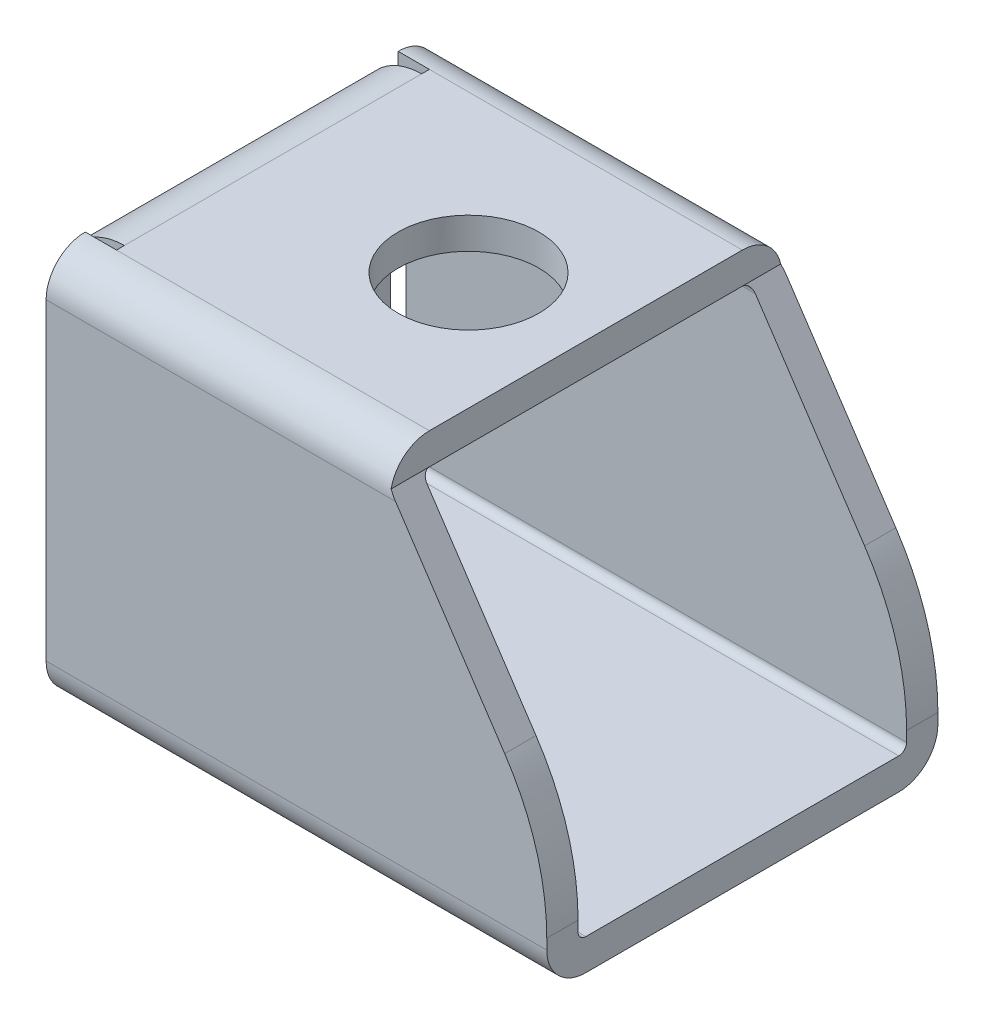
ISO-10303-21;
HEADER;
FILE_DESCRIPTION(('STEP AP214'),'2;1');
FILE_NAME('part.step','',(''),(''),'','','');
FILE_SCHEMA(('AUTOMOTIVE_DESIGN { 1 0 10303 214 1 1 1 1 }'));
ENDSEC;
DATA;
#1=APPLICATION_CONTEXT('core data for automotive mechanical design processes');
#2=APPLICATION_PROTOCOL_DEFINITION('international standard','automotive_design',2000,#1);
#3=PRODUCT_CONTEXT('',#1,'mechanical');
#4=PRODUCT('Part','Part','',(#3));
#5=PRODUCT_RELATED_PRODUCT_CATEGORY('part','',(#4));
#6=PRODUCT_DEFINITION_FORMATION('','',#4);
#7=PRODUCT_DEFINITION_CONTEXT('part definition',#1,'design');
#8=PRODUCT_DEFINITION('design','',#6,#7);
#9=PRODUCT_DEFINITION_SHAPE('','',#8);
#10=(LENGTH_UNIT() NAMED_UNIT(*) SI_UNIT(.MILLI.,.METRE.));
#11=(NAMED_UNIT(*) PLANE_ANGLE_UNIT() SI_UNIT($,.RADIAN.));
#12=(NAMED_UNIT(*) SI_UNIT($,.STERADIAN.) SOLID_ANGLE_UNIT());
#13=UNCERTAINTY_MEASURE_WITH_UNIT(LENGTH_MEASURE(1.E-05),#10,'distance_accuracy_value','');
#14=(GEOMETRIC_REPRESENTATION_CONTEXT(3) GLOBAL_UNCERTAINTY_ASSIGNED_CONTEXT((#13)) GLOBAL_UNIT_ASSIGNED_CONTEXT((#10,
#11,#12)) REPRESENTATION_CONTEXT('',''));
#15=CARTESIAN_POINT('',(0.,0.,0.));
#16=DIRECTION('',(0.,0.,1.));
#17=DIRECTION('',(1.,0.,0.));
#18=AXIS2_PLACEMENT_3D('',#15,#16,#17);
#19=CARTESIAN_POINT('',(2.,0.,0.));
#20=DIRECTION('',(1.,0.,0.));
#21=DIRECTION('',(0.,0.,-1.));
#22=AXIS2_PLACEMENT_3D('',#19,#20,#21);
#23=PLANE('',#22);
#24=DIRECTION('',(0.,1.,0.));
#25=VECTOR('',#24,1.);
#26=CARTESIAN_POINT('',(2.,10.5,9.5));
#27=LINE('',#26,#25);
#28=CARTESIAN_POINT('',(2.,10.5,9.49999999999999));
#29=VERTEX_POINT('',#28);
#30=CARTESIAN_POINT('',(2.,12.5,9.49999999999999));
#31=VERTEX_POINT('',#30);
#32=EDGE_CURVE('E244',#29,#31,#27,.T.);
#33=ORIENTED_EDGE('',*,*,#32,.F.);
#34=DIRECTION('',(0.,0.,1.));
#35=VECTOR('',#34,1.);
#36=CARTESIAN_POINT('',(2.,10.5,-9.99999999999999));
#37=LINE('',#36,#35);
#38=CARTESIAN_POINT('',(2.,10.5,9.99999999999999));
#39=VERTEX_POINT('',#38);
#40=EDGE_CURVE('E233',#29,#39,#37,.T.);
#41=ORIENTED_EDGE('',*,*,#40,.T.);
#42=DIRECTION('',(0.,1.,0.));
#43=VECTOR('',#42,1.);
#44=CARTESIAN_POINT('',(2.,10.5,9.99999999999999));
#45=LINE('',#44,#43);
#46=CARTESIAN_POINT('',(2.,12.5,9.99999999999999));
#47=VERTEX_POINT('',#46);
#48=EDGE_CURVE('E232',#39,#47,#45,.T.);
#49=ORIENTED_EDGE('',*,*,#48,.T.);
#50=DIRECTION('',(0.,0.,-1.));
#51=VECTOR('',#50,1.);
#52=CARTESIAN_POINT('',(2.,12.5,-9.99999999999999));
#53=LINE('',#52,#51);
#54=EDGE_CURVE('E481',#47,#31,#53,.T.);
#55=ORIENTED_EDGE('',*,*,#54,.T.);
#56=EDGE_LOOP('',(#33,#41,#49,#55));
#57=FACE_BOUND('',#56,.T.);
#58=ADVANCED_FACE('F32',(#57),#23,.F.);
#59=DIRECTION('',(0.,-1.,0.));
#60=VECTOR('',#59,1.);
#61=CARTESIAN_POINT('',(2.,12.5,-9.5));
#62=LINE('',#61,#60);
#63=CARTESIAN_POINT('',(2.,12.5,-9.5));
#64=VERTEX_POINT('',#63);
#65=CARTESIAN_POINT('',(2.,10.5,-9.5));
#66=VERTEX_POINT('',#65);
#67=EDGE_CURVE('E49',#64,#66,#62,.T.);
#68=ORIENTED_EDGE('',*,*,#67,.F.);
#69=CARTESIAN_POINT('',(2.,12.5,-9.99999999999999));
#70=VERTEX_POINT('',#69);
#71=EDGE_CURVE('E491',#64,#70,#53,.T.);
#72=ORIENTED_EDGE('',*,*,#71,.T.);
#73=DIRECTION('',(0.,-1.,0.));
#74=VECTOR('',#73,1.);
#75=CARTESIAN_POINT('',(2.,10.5,-9.99999999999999));
#76=LINE('',#75,#74);
#77=CARTESIAN_POINT('',(2.,10.5,-9.99999999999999));
#78=VERTEX_POINT('',#77);
#79=EDGE_CURVE('E228',#70,#78,#76,.T.);
#80=ORIENTED_EDGE('',*,*,#79,.T.);
#81=EDGE_CURVE('E224',#78,#66,#37,.T.);
#82=ORIENTED_EDGE('',*,*,#81,.T.);
#83=EDGE_LOOP('',(#68,#72,#80,#82));
#84=FACE_BOUND('',#83,.T.);
#85=ADVANCED_FACE('F226',(#84),#23,.F.);
#86=CARTESIAN_POINT('',(32.,-10.,9.99999999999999));
#87=DIRECTION('',(1.,0.,0.));
#88=DIRECTION('',(0.,0.,-1.));
#89=AXIS2_PLACEMENT_3D('',#86,#87,#88);
#90=PLANE('',#89);
#91=DIRECTION('',(0.,1.,0.));
#92=VECTOR('',#91,1.);
#93=CARTESIAN_POINT('',(32.,9.99999999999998,-12.5));
#94=LINE('',#93,#92);
#95=CARTESIAN_POINT('',(32.,-9.99999999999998,-12.5));
#96=VERTEX_POINT('',#95);
#97=CARTESIAN_POINT('',(32.,-9.34441020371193,-12.5));
#98=VERTEX_POINT('',#97);
#99=EDGE_CURVE('E389',#96,#98,#94,.T.);
#100=ORIENTED_EDGE('',*,*,#99,.T.);
#101=DIRECTION('',(0.,0.,-1.));
#102=VECTOR('',#101,1.);
#103=CARTESIAN_POINT('',(32.,-9.34441020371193,9.99999999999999));
#104=LINE('',#103,#102);
#105=CARTESIAN_POINT('',(32.,-9.34441020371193,-10.5));
#106=VERTEX_POINT('',#105);
#107=EDGE_CURVE('E333',#98,#106,#104,.F.);
#108=ORIENTED_EDGE('',*,*,#107,.T.);
#109=DIRECTION('',(0.,1.,0.));
#110=VECTOR('',#109,1.);
#111=CARTESIAN_POINT('',(32.,9.99999999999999,-10.5));
#112=LINE('',#111,#110);
#113=CARTESIAN_POINT('',(32.,-9.99999999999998,-10.5));
#114=VERTEX_POINT('',#113);
#115=EDGE_CURVE('E413',#114,#106,#112,.T.);
#116=ORIENTED_EDGE('',*,*,#115,.F.);
#117=CARTESIAN_POINT('',(32.,-10.,-10.));
#118=DIRECTION('',(1.,0.,0.));
#119=DIRECTION('',(0.,0.,-1.));
#120=AXIS2_PLACEMENT_3D('',#117,#118,#119);
#121=CIRCLE('',#120,0.499999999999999);
#122=CARTESIAN_POINT('',(32.,-10.5,-10.));
#123=VERTEX_POINT('',#122);
#124=EDGE_CURVE('E439',#123,#114,#121,.T.);
#125=ORIENTED_EDGE('',*,*,#124,.F.);
#126=DIRECTION('',(0.,0.,-1.));
#127=VECTOR('',#126,1.);
#128=CARTESIAN_POINT('',(32.,-10.5,9.99999999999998));
#129=LINE('',#128,#127);
#130=CARTESIAN_POINT('',(32.,-10.5,9.99999999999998));
#131=VERTEX_POINT('',#130);
#132=EDGE_CURVE('E441',#131,#123,#129,.T.);
#133=ORIENTED_EDGE('',*,*,#132,.F.);
#134=CARTESIAN_POINT('',(32.,-10.,9.99999999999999));
#135=DIRECTION('',(1.,0.,0.));
#136=DIRECTION('',(0.,0.,-1.));
#137=AXIS2_PLACEMENT_3D('',#134,#135,#136);
#138=CIRCLE('',#137,0.5);
#139=CARTESIAN_POINT('',(32.,-10.,10.5));
#140=VERTEX_POINT('',#139);
#141=EDGE_CURVE('E443',#140,#131,#138,.T.);
#142=ORIENTED_EDGE('',*,*,#141,.F.);
#143=DIRECTION('',(0.,-1.,0.));
#144=VECTOR('',#143,1.);
#145=CARTESIAN_POINT('',(32.,9.99999999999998,10.5));
#146=LINE('',#145,#144);
#147=CARTESIAN_POINT('',(32.,-9.34441020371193,10.5));
#148=VERTEX_POINT('',#147);
#149=EDGE_CURVE('E417',#148,#140,#146,.T.);
#150=ORIENTED_EDGE('',*,*,#149,.F.);
#151=DIRECTION('',(0.,0.,-1.));
#152=VECTOR('',#151,1.);
#153=CARTESIAN_POINT('',(32.,-9.34441020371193,9.99999999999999));
#154=LINE('',#153,#152);
#155=CARTESIAN_POINT('',(32.,-9.34441020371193,12.5));
#156=VERTEX_POINT('',#155);
#157=EDGE_CURVE('E335',#148,#156,#154,.F.);
#158=ORIENTED_EDGE('',*,*,#157,.T.);
#159=DIRECTION('',(0.,-1.,0.));
#160=VECTOR('',#159,1.);
#161=CARTESIAN_POINT('',(32.,9.99999999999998,12.5));
#162=LINE('',#161,#160);
#163=CARTESIAN_POINT('',(32.,-9.99999999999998,12.5));
#164=VERTEX_POINT('',#163);
#165=EDGE_CURVE('E367',#156,#164,#162,.T.);
#166=ORIENTED_EDGE('',*,*,#165,.T.);
#167=CARTESIAN_POINT('',(32.,-10.,9.99999999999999));
#168=DIRECTION('',(1.,0.,0.));
#169=DIRECTION('',(0.,0.,-1.));
#170=AXIS2_PLACEMENT_3D('',#167,#168,#169);
#171=CIRCLE('',#170,2.5);
#172=CARTESIAN_POINT('',(32.,-12.5,9.99999999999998));
#173=VERTEX_POINT('',#172);
#174=EDGE_CURVE('E370',#164,#173,#171,.T.);
#175=ORIENTED_EDGE('',*,*,#174,.T.);
#176=DIRECTION('',(0.,0.,-1.));
#177=VECTOR('',#176,1.);
#178=CARTESIAN_POINT('',(32.,-12.5,9.99999999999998));
#179=LINE('',#178,#177);
#180=CARTESIAN_POINT('',(32.,-12.5,-9.99999999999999));
#181=VERTEX_POINT('',#180);
#182=EDGE_CURVE('E394',#173,#181,#179,.T.);
#183=ORIENTED_EDGE('',*,*,#182,.T.);
#184=CARTESIAN_POINT('',(32.,-10.,-10.));
#185=DIRECTION('',(1.,0.,0.));
#186=DIRECTION('',(0.,0.,-1.));
#187=AXIS2_PLACEMENT_3D('',#184,#185,#186);
#188=CIRCLE('',#187,2.5);
#189=EDGE_CURVE('E392',#181,#96,#188,.T.);
#190=ORIENTED_EDGE('',*,*,#189,.T.);
#191=EDGE_LOOP('',(#100,#108,#116,#125,#133,#142,#150,#158,#166,#175,#183,#190));
#192=FACE_BOUND('',#191,.T.);
#193=ADVANCED_FACE('F538',(#192),#90,.T.);
#194=CARTESIAN_POINT('',(32.,9.99999999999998,-12.5));
#195=DIRECTION('',(0.,0.,1.));
#196=DIRECTION('',(0.,-1.,0.));
#197=AXIS2_PLACEMENT_3D('',#194,#195,#196);
#198=PLANE('',#197);
#199=DIRECTION('',(-0.55470019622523,0.832050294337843,0.));
#200=VECTOR('',#199,1.);
#201=CARTESIAN_POINT('',(25.3076923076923,5.53846153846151,-12.5));
#202=LINE('',#201,#200);
#203=CARTESIAN_POINT('',(29.3128047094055,-0.469207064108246,-12.5));
#204=VERTEX_POINT('',#203);
#205=CARTESIAN_POINT('',(22.3333333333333,9.99999999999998,-12.5));
#206=VERTEX_POINT('',#205);
#207=EDGE_CURVE('E449',#204,#206,#202,.T.);
#208=ORIENTED_EDGE('',*,*,#207,.F.);
#209=CARTESIAN_POINT('',(16.,-9.34441020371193,-12.5));
#210=DIRECTION('',(0.,0.,1.));
#211=DIRECTION('',(0.,-1.,0.));
#212=AXIS2_PLACEMENT_3D('',#209,#210,#211);
#213=CIRCLE('',#212,16.);
#214=EDGE_CURVE('E337',#204,#98,#213,.F.);
#215=ORIENTED_EDGE('',*,*,#214,.T.);
#216=ORIENTED_EDGE('',*,*,#99,.F.);
#217=DIRECTION('',(-1.,0.,0.));
#218=VECTOR('',#217,1.);
#219=CARTESIAN_POINT('',(32.,-9.99999999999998,-12.5));
#220=LINE('',#219,#218);
#221=CARTESIAN_POINT('',(0.,-9.99999999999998,-12.5));
#222=VERTEX_POINT('',#221);
#223=EDGE_CURVE('E351',#96,#222,#220,.T.);
#224=ORIENTED_EDGE('',*,*,#223,.T.);
#225=DIRECTION('',(0.,1.,0.));
#226=VECTOR('',#225,1.);
#227=CARTESIAN_POINT('',(0.,9.99999999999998,-12.5));
#228=LINE('',#227,#226);
#229=CARTESIAN_POINT('',(0.,9.99999999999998,-12.5));
#230=VERTEX_POINT('',#229);
#231=EDGE_CURVE('E377',#222,#230,#228,.T.);
#232=ORIENTED_EDGE('',*,*,#231,.T.);
#233=DIRECTION('',(-1.,0.,0.));
#234=VECTOR('',#233,1.);
#235=CARTESIAN_POINT('',(32.,9.99999999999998,-12.5));
#236=LINE('',#235,#234);
#237=EDGE_CURVE('E354',#206,#230,#236,.T.);
#238=ORIENTED_EDGE('',*,*,#237,.F.);
#239=EDGE_LOOP('',(#208,#215,#216,#224,#232,#238));
#240=FACE_BOUND('',#239,.T.);
#241=ADVANCED_FACE('F577',(#240),#198,.F.);
#242=CARTESIAN_POINT('',(32.,10.,-10.));
#243=DIRECTION('',(-1.,0.,0.));
#244=DIRECTION('',(0.,0.,1.));
#245=AXIS2_PLACEMENT_3D('',#242,#243,#244);
#246=CYLINDRICAL_SURFACE('',#245,2.5);
#247=CARTESIAN_POINT('',(22.,10.,-10.));
#248=DIRECTION('',(1.,0.,0.));
#249=DIRECTION('',(0.,0.,-1.));
#250=AXIS2_PLACEMENT_3D('',#247,#248,#249);
#251=CIRCLE('',#250,2.5);
#252=CARTESIAN_POINT('',(22.,10.5,-12.4494897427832));
#253=VERTEX_POINT('',#252);
#254=CARTESIAN_POINT('',(22.,12.5,-9.99999999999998));
#255=VERTEX_POINT('',#254);
#256=EDGE_CURVE('E436',#253,#255,#251,.T.);
#257=ORIENTED_EDGE('',*,*,#256,.F.);
#258=CARTESIAN_POINT('',(22.3333333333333,10.,-10.));
#259=DIRECTION('',(0.832050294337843,0.55470019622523,0.));
#260=DIRECTION('',(-0.55470019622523,0.832050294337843,0.));
#261=AXIS2_PLACEMENT_3D('',#258,#259,#260);
#262=ELLIPSE('',#261,3.00462606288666,2.5);
#263=EDGE_CURVE('E451',#206,#253,#262,.T.);
#264=ORIENTED_EDGE('',*,*,#263,.F.);
#265=ORIENTED_EDGE('',*,*,#237,.T.);
#266=CARTESIAN_POINT('',(0.,10.,-10.));
#267=DIRECTION('',(1.,0.,0.));
#268=DIRECTION('',(0.,0.,1.));
#269=AXIS2_PLACEMENT_3D('',#266,#267,#268);
#270=CIRCLE('',#269,2.5);
#271=CARTESIAN_POINT('',(0.,12.5,-9.99999999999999));
#272=VERTEX_POINT('',#271);
#273=EDGE_CURVE('E374',#230,#272,#270,.T.);
#274=ORIENTED_EDGE('',*,*,#273,.T.);
#275=DIRECTION('',(-1.,0.,0.));
#276=VECTOR('',#275,1.);
#277=CARTESIAN_POINT('',(2.,12.5,-9.99999999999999));
#278=LINE('',#277,#276);
#279=EDGE_CURVE('E476',#70,#272,#278,.T.);
#280=ORIENTED_EDGE('',*,*,#279,.F.);
#281=DIRECTION('',(-1.,0.,0.));
#282=VECTOR('',#281,1.);
#283=CARTESIAN_POINT('',(32.,12.5,-9.99999999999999));
#284=LINE('',#283,#282);
#285=EDGE_CURVE('E356',#255,#70,#284,.T.);
#286=ORIENTED_EDGE('',*,*,#285,.F.);
#287=EDGE_LOOP('',(#257,#264,#265,#274,#280,#286));
#288=FACE_BOUND('',#287,.T.);
#289=ADVANCED_FACE('F571',(#288),#246,.T.);
#290=CARTESIAN_POINT('',(32.,12.5,9.99999999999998));
#291=DIRECTION('',(0.,-1.,0.));
#292=DIRECTION('',(0.,0.,-1.));
#293=AXIS2_PLACEMENT_3D('',#290,#291,#292);
#294=PLANE('',#293);
#295=CARTESIAN_POINT('',(14.5,12.5,0.));
#296=DIRECTION('',(0.,1.,0.));
#297=DIRECTION('',(0.,0.,1.));
#298=AXIS2_PLACEMENT_3D('',#295,#296,#297);
#299=CIRCLE('',#298,4.5);
#300=CARTESIAN_POINT('',(14.5,12.5,4.5));
#301=VERTEX_POINT('',#300);
#302=EDGE_CURVE('E261',#301,#301,#299,.T.);
#303=ORIENTED_EDGE('',*,*,#302,.F.);
#304=EDGE_LOOP('',(#303));
#305=FACE_BOUND('',#304,.T.);
#306=ORIENTED_EDGE('',*,*,#285,.T.);
#307=ORIENTED_EDGE('',*,*,#71,.F.);
#308=DIRECTION('',(0.,0.,-1.));
#309=VECTOR('',#308,1.);
#310=CARTESIAN_POINT('',(2.,12.5,9.5));
#311=LINE('',#310,#309);
#312=EDGE_CURVE('E56',#31,#64,#311,.T.);
#313=ORIENTED_EDGE('',*,*,#312,.F.);
#314=ORIENTED_EDGE('',*,*,#54,.F.);
#315=DIRECTION('',(-1.,0.,0.));
#316=VECTOR('',#315,1.);
#317=CARTESIAN_POINT('',(32.,12.5,9.99999999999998));
#318=LINE('',#317,#316);
#319=CARTESIAN_POINT('',(22.,12.5,10.));
#320=VERTEX_POINT('',#319);
#321=EDGE_CURVE('E359',#320,#47,#318,.T.);
#322=ORIENTED_EDGE('',*,*,#321,.F.);
#323=DIRECTION('',(0.,0.,-1.));
#324=VECTOR('',#323,1.);
#325=CARTESIAN_POINT('',(22.,12.5,75.2330950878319));
#326=LINE('',#325,#324);
#327=EDGE_CURVE('E469',#320,#255,#326,.T.);
#328=ORIENTED_EDGE('',*,*,#327,.T.);
#329=EDGE_LOOP('',(#306,#307,#313,#314,#322,#328));
#330=FACE_BOUND('',#329,.T.);
#331=ADVANCED_FACE('F498',(#305,#330),#294,.F.);
#332=CARTESIAN_POINT('',(32.,10.,10.));
#333=DIRECTION('',(-1.,0.,0.));
#334=DIRECTION('',(0.,0.,1.));
#335=AXIS2_PLACEMENT_3D('',#332,#333,#334);
#336=CYLINDRICAL_SURFACE('',#335,2.5);
#337=CARTESIAN_POINT('',(22.,10.,10.));
#338=DIRECTION('',(1.,0.,0.));
#339=DIRECTION('',(0.,0.,-1.));
#340=AXIS2_PLACEMENT_3D('',#337,#338,#339);
#341=CIRCLE('',#340,2.5);
#342=CARTESIAN_POINT('',(22.,10.5,12.4494897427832));
#343=VERTEX_POINT('',#342);
#344=EDGE_CURVE('E447',#320,#343,#341,.T.);
#345=ORIENTED_EDGE('',*,*,#344,.F.);
#346=ORIENTED_EDGE('',*,*,#321,.T.);
#347=DIRECTION('',(-1.,0.,0.));
#348=VECTOR('',#347,1.);
#349=CARTESIAN_POINT('',(2.,12.5,9.99999999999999));
#350=LINE('',#349,#348);
#351=CARTESIAN_POINT('',(0.,12.5,9.99999999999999));
#352=VERTEX_POINT('',#351);
#353=EDGE_CURVE('E483',#47,#352,#350,.T.);
#354=ORIENTED_EDGE('',*,*,#353,.T.);
#355=CARTESIAN_POINT('',(0.,10.,10.));
#356=DIRECTION('',(1.,0.,0.));
#357=DIRECTION('',(0.,0.,-1.));
#358=AXIS2_PLACEMENT_3D('',#355,#356,#357);
#359=CIRCLE('',#358,2.5);
#360=CARTESIAN_POINT('',(0.,9.99999999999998,12.5));
#361=VERTEX_POINT('',#360);
#362=EDGE_CURVE('E371',#352,#361,#359,.T.);
#363=ORIENTED_EDGE('',*,*,#362,.T.);
#364=DIRECTION('',(-1.,0.,0.));
#365=VECTOR('',#364,1.);
#366=CARTESIAN_POINT('',(32.,9.99999999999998,12.5));
#367=LINE('',#366,#365);
#368=CARTESIAN_POINT('',(22.3333333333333,9.99999999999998,12.5));
#369=VERTEX_POINT('',#368);
#370=EDGE_CURVE('E362',#369,#361,#367,.T.);
#371=ORIENTED_EDGE('',*,*,#370,.F.);
#372=CARTESIAN_POINT('',(22.3333333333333,10.,10.));
#373=DIRECTION('',(0.832050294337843,0.55470019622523,0.));
#374=DIRECTION('',(-0.55470019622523,0.832050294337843,0.));
#375=AXIS2_PLACEMENT_3D('',#372,#373,#374);
#376=ELLIPSE('',#375,3.00462606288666,2.5);
#377=EDGE_CURVE('E453',#343,#369,#376,.T.);
#378=ORIENTED_EDGE('',*,*,#377,.F.);
#379=EDGE_LOOP('',(#345,#346,#354,#363,#371,#378));
#380=FACE_BOUND('',#379,.T.);
#381=ADVANCED_FACE('F501',(#380),#336,.T.);
#382=CARTESIAN_POINT('',(32.,9.99999999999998,12.5));
#383=DIRECTION('',(0.,0.,-1.));
#384=DIRECTION('',(0.,1.,0.));
#385=AXIS2_PLACEMENT_3D('',#382,#383,#384);
#386=PLANE('',#385);
#387=ORIENTED_EDGE('',*,*,#165,.F.);
#388=CARTESIAN_POINT('',(16.,-9.34441020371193,12.5));
#389=DIRECTION('',(0.,0.,-1.));
#390=DIRECTION('',(0.,1.,0.));
#391=AXIS2_PLACEMENT_3D('',#388,#389,#390);
#392=CIRCLE('',#391,16.);
#393=CARTESIAN_POINT('',(29.3128047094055,-0.469207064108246,12.5));
#394=VERTEX_POINT('',#393);
#395=EDGE_CURVE('E11',#156,#394,#392,.F.);
#396=ORIENTED_EDGE('',*,*,#395,.T.);
#397=DIRECTION('',(0.55470019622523,-0.832050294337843,0.));
#398=VECTOR('',#397,1.);
#399=CARTESIAN_POINT('',(25.3076923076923,5.53846153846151,12.5));
#400=LINE('',#399,#398);
#401=EDGE_CURVE('E455',#369,#394,#400,.T.);
#402=ORIENTED_EDGE('',*,*,#401,.F.);
#403=ORIENTED_EDGE('',*,*,#370,.T.);
#404=DIRECTION('',(0.,-1.,0.));
#405=VECTOR('',#404,1.);
#406=CARTESIAN_POINT('',(0.,9.99999999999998,12.5));
#407=LINE('',#406,#405);
#408=CARTESIAN_POINT('',(0.,-9.99999999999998,12.5));
#409=VERTEX_POINT('',#408);
#410=EDGE_CURVE('E368',#361,#409,#407,.T.);
#411=ORIENTED_EDGE('',*,*,#410,.T.);
#412=DIRECTION('',(-1.,0.,0.));
#413=VECTOR('',#412,1.);
#414=CARTESIAN_POINT('',(32.,-9.99999999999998,12.5));
#415=LINE('',#414,#413);
#416=EDGE_CURVE('E364',#164,#409,#415,.T.);
#417=ORIENTED_EDGE('',*,*,#416,.F.);
#418=EDGE_LOOP('',(#387,#396,#402,#403,#411,#417));
#419=FACE_BOUND('',#418,.T.);
#420=ADVANCED_FACE('F526',(#419),#386,.F.);
#421=CARTESIAN_POINT('',(32.,10.,10.));
#422=DIRECTION('',(-1.,0.,0.));
#423=DIRECTION('',(0.,0.,1.));
#424=AXIS2_PLACEMENT_3D('',#421,#422,#423);
#425=CYLINDRICAL_SURFACE('',#424,0.5);
#426=DIRECTION('',(-1.,0.,0.));
#427=VECTOR('',#426,1.);
#428=CARTESIAN_POINT('',(32.,10.5,9.99999999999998));
#429=LINE('',#428,#427);
#430=CARTESIAN_POINT('',(22.,10.5,9.99999999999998));
#431=VERTEX_POINT('',#430);
#432=EDGE_CURVE('E411',#431,#39,#429,.T.);
#433=ORIENTED_EDGE('',*,*,#432,.F.);
#434=CARTESIAN_POINT('',(22.3333333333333,10.,10.));
#435=DIRECTION('',(0.832050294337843,0.55470019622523,0.));
#436=DIRECTION('',(-0.55470019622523,0.832050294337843,0.));
#437=AXIS2_PLACEMENT_3D('',#434,#435,#436);
#438=ELLIPSE('',#437,0.600925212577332,0.5);
#439=CARTESIAN_POINT('',(22.3333333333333,9.99999999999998,10.5));
#440=VERTEX_POINT('',#439);
#441=EDGE_CURVE('E458',#431,#440,#438,.T.);
#442=ORIENTED_EDGE('',*,*,#441,.T.);
#443=DIRECTION('',(-1.,0.,0.));
#444=VECTOR('',#443,1.);
#445=CARTESIAN_POINT('',(32.,9.99999999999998,10.5));
#446=LINE('',#445,#444);
#447=CARTESIAN_POINT('',(0.,9.99999999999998,10.5));
#448=VERTEX_POINT('',#447);
#449=EDGE_CURVE('E387',#440,#448,#446,.T.);
#450=ORIENTED_EDGE('',*,*,#449,.T.);
#451=CARTESIAN_POINT('',(0.,10.,10.));
#452=DIRECTION('',(1.,0.,0.));
#453=DIRECTION('',(0.,0.,-1.));
#454=AXIS2_PLACEMENT_3D('',#451,#452,#453);
#455=CIRCLE('',#454,0.5);
#456=CARTESIAN_POINT('',(0.,10.5,9.99999999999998));
#457=VERTEX_POINT('',#456);
#458=EDGE_CURVE('E433',#457,#448,#455,.T.);
#459=ORIENTED_EDGE('',*,*,#458,.F.);
#460=DIRECTION('',(-1.,0.,0.));
#461=VECTOR('',#460,1.);
#462=CARTESIAN_POINT('',(2.,10.5,9.99999999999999));
#463=LINE('',#462,#461);
#464=EDGE_CURVE('E480',#39,#457,#463,.T.);
#465=ORIENTED_EDGE('',*,*,#464,.F.);
#466=EDGE_LOOP('',(#433,#442,#450,#459,#465));
#467=FACE_BOUND('',#466,.T.);
#468=ADVANCED_FACE('F516',(#467),#425,.F.);
#469=CARTESIAN_POINT('',(32.,9.99999999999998,10.5));
#470=DIRECTION('',(0.,0.,-1.));
#471=DIRECTION('',(0.,1.,0.));
#472=AXIS2_PLACEMENT_3D('',#469,#470,#471);
#473=PLANE('',#472);
#474=DIRECTION('',(0.55470019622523,-0.832050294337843,0.));
#475=VECTOR('',#474,1.);
#476=CARTESIAN_POINT('',(25.3076923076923,5.53846153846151,10.5));
#477=LINE('',#476,#475);
#478=CARTESIAN_POINT('',(29.3128047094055,-0.469207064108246,10.5));
#479=VERTEX_POINT('',#478);
#480=EDGE_CURVE('E461',#440,#479,#477,.T.);
#481=ORIENTED_EDGE('',*,*,#480,.T.);
#482=CARTESIAN_POINT('',(16.,-9.34441020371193,10.5));
#483=DIRECTION('',(0.,0.,-1.));
#484=DIRECTION('',(0.,1.,0.));
#485=AXIS2_PLACEMENT_3D('',#482,#483,#484);
#486=CIRCLE('',#485,16.);
#487=EDGE_CURVE('E41',#479,#148,#486,.T.);
#488=ORIENTED_EDGE('',*,*,#487,.T.);
#489=ORIENTED_EDGE('',*,*,#149,.T.);
#490=DIRECTION('',(-1.,0.,0.));
#491=VECTOR('',#490,1.);
#492=CARTESIAN_POINT('',(32.,-10.,10.5));
#493=LINE('',#492,#491);
#494=CARTESIAN_POINT('',(0.,-10.,10.5));
#495=VERTEX_POINT('',#494);
#496=EDGE_CURVE('E399',#140,#495,#493,.T.);
#497=ORIENTED_EDGE('',*,*,#496,.T.);
#498=DIRECTION('',(0.,-1.,0.));
#499=VECTOR('',#498,1.);
#500=CARTESIAN_POINT('',(0.,9.99999999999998,10.5));
#501=LINE('',#500,#499);
#502=EDGE_CURVE('E430',#448,#495,#501,.T.);
#503=ORIENTED_EDGE('',*,*,#502,.F.);
#504=ORIENTED_EDGE('',*,*,#449,.F.);
#505=EDGE_LOOP('',(#481,#488,#489,#497,#503,#504));
#506=FACE_BOUND('',#505,.T.);
#507=ADVANCED_FACE('F534',(#506),#473,.T.);
#508=CARTESIAN_POINT('',(32.,9.99999999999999,-10.5));
#509=DIRECTION('',(0.,0.,1.));
#510=DIRECTION('',(0.,-1.,0.));
#511=AXIS2_PLACEMENT_3D('',#508,#509,#510);
#512=PLANE('',#511);
#513=ORIENTED_EDGE('',*,*,#115,.T.);
#514=CARTESIAN_POINT('',(16.,-9.34441020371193,-10.5));
#515=DIRECTION('',(0.,0.,1.));
#516=DIRECTION('',(0.,-1.,0.));
#517=AXIS2_PLACEMENT_3D('',#514,#515,#516);
#518=CIRCLE('',#517,16.);
#519=CARTESIAN_POINT('',(29.3128047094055,-0.469207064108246,-10.5));
#520=VERTEX_POINT('',#519);
#521=EDGE_CURVE('E331',#106,#520,#518,.T.);
#522=ORIENTED_EDGE('',*,*,#521,.T.);
#523=DIRECTION('',(-0.55470019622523,0.832050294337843,0.));
#524=VECTOR('',#523,1.);
#525=CARTESIAN_POINT('',(25.3076923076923,5.53846153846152,-10.5));
#526=LINE('',#525,#524);
#527=CARTESIAN_POINT('',(22.3333333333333,9.99999999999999,-10.5));
#528=VERTEX_POINT('',#527);
#529=EDGE_CURVE('E464',#520,#528,#526,.T.);
#530=ORIENTED_EDGE('',*,*,#529,.T.);
#531=DIRECTION('',(-1.,0.,0.));
#532=VECTOR('',#531,1.);
#533=CARTESIAN_POINT('',(32.,9.99999999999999,-10.5));
#534=LINE('',#533,#532);
#535=CARTESIAN_POINT('',(0.,9.99999999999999,-10.5));
#536=VERTEX_POINT('',#535);
#537=EDGE_CURVE('E407',#528,#536,#534,.T.);
#538=ORIENTED_EDGE('',*,*,#537,.T.);
#539=DIRECTION('',(0.,1.,0.));
#540=VECTOR('',#539,1.);
#541=CARTESIAN_POINT('',(0.,9.99999999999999,-10.5));
#542=LINE('',#541,#540);
#543=CARTESIAN_POINT('',(0.,-9.99999999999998,-10.5));
#544=VERTEX_POINT('',#543);
#545=EDGE_CURVE('E418',#544,#536,#542,.T.);
#546=ORIENTED_EDGE('',*,*,#545,.F.);
#547=DIRECTION('',(-1.,0.,0.));
#548=VECTOR('',#547,1.);
#549=CARTESIAN_POINT('',(32.,-9.99999999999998,-10.5));
#550=LINE('',#549,#548);
#551=EDGE_CURVE('E405',#114,#544,#550,.T.);
#552=ORIENTED_EDGE('',*,*,#551,.F.);
#553=EDGE_LOOP('',(#513,#522,#530,#538,#546,#552));
#554=FACE_BOUND('',#553,.T.);
#555=ADVANCED_FACE('F557',(#554),#512,.T.);
#556=CARTESIAN_POINT('',(32.,10.,-10.));
#557=DIRECTION('',(-1.,0.,0.));
#558=DIRECTION('',(0.,0.,1.));
#559=AXIS2_PLACEMENT_3D('',#556,#557,#558);
#560=CYLINDRICAL_SURFACE('',#559,0.5);
#561=ORIENTED_EDGE('',*,*,#537,.F.);
#562=CARTESIAN_POINT('',(22.3333333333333,10.,-10.));
#563=DIRECTION('',(0.832050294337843,0.55470019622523,0.));
#564=DIRECTION('',(-0.55470019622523,0.832050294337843,0.));
#565=AXIS2_PLACEMENT_3D('',#562,#563,#564);
#566=ELLIPSE('',#565,0.600925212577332,0.5);
#567=CARTESIAN_POINT('',(22.,10.5,-9.99999999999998));
#568=VERTEX_POINT('',#567);
#569=EDGE_CURVE('E466',#528,#568,#566,.T.);
#570=ORIENTED_EDGE('',*,*,#569,.T.);
#571=DIRECTION('',(-1.,0.,0.));
#572=VECTOR('',#571,1.);
#573=CARTESIAN_POINT('',(32.,10.5,-9.99999999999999));
#574=LINE('',#573,#572);
#575=EDGE_CURVE('E409',#568,#78,#574,.T.);
#576=ORIENTED_EDGE('',*,*,#575,.T.);
#577=DIRECTION('',(-1.,0.,0.));
#578=VECTOR('',#577,1.);
#579=CARTESIAN_POINT('',(2.,10.5,-9.99999999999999));
#580=LINE('',#579,#578);
#581=CARTESIAN_POINT('',(0.,10.5,-9.99999999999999));
#582=VERTEX_POINT('',#581);
#583=EDGE_CURVE('E477',#78,#582,#580,.T.);
#584=ORIENTED_EDGE('',*,*,#583,.T.);
#585=CARTESIAN_POINT('',(0.,10.,-10.));
#586=DIRECTION('',(1.,0.,0.));
#587=DIRECTION('',(0.,0.,1.));
#588=AXIS2_PLACEMENT_3D('',#585,#586,#587);
#589=CIRCLE('',#588,0.5);
#590=EDGE_CURVE('E414',#536,#582,#589,.T.);
#591=ORIENTED_EDGE('',*,*,#590,.F.);
#592=EDGE_LOOP('',(#561,#570,#576,#584,#591));
#593=FACE_BOUND('',#592,.T.);
#594=ADVANCED_FACE('F563',(#593),#560,.F.);
#595=CARTESIAN_POINT('',(32.,10.5,9.99999999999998));
#596=DIRECTION('',(0.,-1.,0.));
#597=DIRECTION('',(0.,0.,-1.));
#598=AXIS2_PLACEMENT_3D('',#595,#596,#597);
#599=PLANE('',#598);
#600=CARTESIAN_POINT('',(14.5,10.5,0.));
#601=DIRECTION('',(0.,-1.,0.));
#602=DIRECTION('',(0.,0.,-1.));
#603=AXIS2_PLACEMENT_3D('',#600,#601,#602);
#604=CIRCLE('',#603,4.5);
#605=CARTESIAN_POINT('',(14.5,10.5,-4.5));
#606=VERTEX_POINT('',#605);
#607=EDGE_CURVE('E668',#606,#606,#604,.F.);
#608=ORIENTED_EDGE('',*,*,#607,.T.);
#609=EDGE_LOOP('',(#608));
#610=FACE_BOUND('',#609,.T.);
#611=ORIENTED_EDGE('',*,*,#81,.F.);
#612=ORIENTED_EDGE('',*,*,#575,.F.);
#613=DIRECTION('',(0.,0.,1.));
#614=VECTOR('',#613,1.);
#615=CARTESIAN_POINT('',(22.,10.5,9.99999999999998));
#616=LINE('',#615,#614);
#617=EDGE_CURVE('E342',#568,#431,#616,.T.);
#618=ORIENTED_EDGE('',*,*,#617,.T.);
#619=ORIENTED_EDGE('',*,*,#432,.T.);
#620=ORIENTED_EDGE('',*,*,#40,.F.);
#621=DIRECTION('',(0.,0.,1.));
#622=VECTOR('',#621,1.);
#623=CARTESIAN_POINT('',(2.,10.5,-9.5));
#624=LINE('',#623,#622);
#625=EDGE_CURVE('E237',#66,#29,#624,.T.);
#626=ORIENTED_EDGE('',*,*,#625,.F.);
#627=EDGE_LOOP('',(#611,#612,#618,#619,#620,#626));
#628=FACE_BOUND('',#627,.T.);
#629=ADVANCED_FACE('F239',(#610,#628),#599,.T.);
#630=CARTESIAN_POINT('',(0.,-10.,9.99999999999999));
#631=DIRECTION('',(1.,0.,0.));
#632=DIRECTION('',(0.,0.,-1.));
#633=AXIS2_PLACEMENT_3D('',#630,#631,#632);
#634=PLANE('',#633);
#635=ORIENTED_EDGE('',*,*,#590,.T.);
#636=DIRECTION('',(0.,-1.,0.));
#637=VECTOR('',#636,1.);
#638=CARTESIAN_POINT('',(0.,10.5,-9.99999999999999));
#639=LINE('',#638,#637);
#640=EDGE_CURVE('E317',#272,#582,#639,.T.);
#641=ORIENTED_EDGE('',*,*,#640,.F.);
#642=ORIENTED_EDGE('',*,*,#273,.F.);
#643=ORIENTED_EDGE('',*,*,#231,.F.);
#644=CARTESIAN_POINT('',(0.,-10.,-10.));
#645=DIRECTION('',(1.,0.,0.));
#646=DIRECTION('',(0.,0.,-1.));
#647=AXIS2_PLACEMENT_3D('',#644,#645,#646);
#648=CIRCLE('',#647,2.5);
#649=CARTESIAN_POINT('',(0.,-12.5,-9.99999999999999));
#650=VERTEX_POINT('',#649);
#651=EDGE_CURVE('E380',#650,#222,#648,.T.);
#652=ORIENTED_EDGE('',*,*,#651,.F.);
#653=DIRECTION('',(0.,0.,-1.));
#654=VECTOR('',#653,1.);
#655=CARTESIAN_POINT('',(0.,-12.5,9.99999999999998));
#656=LINE('',#655,#654);
#657=CARTESIAN_POINT('',(0.,-12.5,9.99999999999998));
#658=VERTEX_POINT('',#657);
#659=EDGE_CURVE('E382',#658,#650,#656,.T.);
#660=ORIENTED_EDGE('',*,*,#659,.F.);
#661=CARTESIAN_POINT('',(0.,-10.,9.99999999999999));
#662=DIRECTION('',(1.,0.,0.));
#663=DIRECTION('',(0.,0.,-1.));
#664=AXIS2_PLACEMENT_3D('',#661,#662,#663);
#665=CIRCLE('',#664,2.5);
#666=EDGE_CURVE('E384',#409,#658,#665,.T.);
#667=ORIENTED_EDGE('',*,*,#666,.F.);
#668=ORIENTED_EDGE('',*,*,#410,.F.);
#669=ORIENTED_EDGE('',*,*,#362,.F.);
#670=DIRECTION('',(0.,1.,0.));
#671=VECTOR('',#670,1.);
#672=CARTESIAN_POINT('',(0.,10.5,9.99999999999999));
#673=LINE('',#672,#671);
#674=EDGE_CURVE('E319',#457,#352,#673,.T.);
#675=ORIENTED_EDGE('',*,*,#674,.F.);
#676=ORIENTED_EDGE('',*,*,#458,.T.);
#677=ORIENTED_EDGE('',*,*,#502,.T.);
#678=CARTESIAN_POINT('',(0.,-10.,9.99999999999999));
#679=DIRECTION('',(1.,0.,0.));
#680=DIRECTION('',(0.,0.,-1.));
#681=AXIS2_PLACEMENT_3D('',#678,#679,#680);
#682=CIRCLE('',#681,0.5);
#683=CARTESIAN_POINT('',(0.,-10.5,9.99999999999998));
#684=VERTEX_POINT('',#683);
#685=EDGE_CURVE('E427',#495,#684,#682,.T.);
#686=ORIENTED_EDGE('',*,*,#685,.T.);
#687=DIRECTION('',(0.,0.,-1.));
#688=VECTOR('',#687,1.);
#689=CARTESIAN_POINT('',(0.,-10.5,9.99999999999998));
#690=LINE('',#689,#688);
#691=CARTESIAN_POINT('',(0.,-10.5,-10.));
#692=VERTEX_POINT('',#691);
#693=EDGE_CURVE('E424',#684,#692,#690,.T.);
#694=ORIENTED_EDGE('',*,*,#693,.T.);
#695=CARTESIAN_POINT('',(0.,-10.,-10.));
#696=DIRECTION('',(1.,0.,0.));
#697=DIRECTION('',(0.,0.,-1.));
#698=AXIS2_PLACEMENT_3D('',#695,#696,#697);
#699=CIRCLE('',#698,0.499999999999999);
#700=EDGE_CURVE('E421',#692,#544,#699,.T.);
#701=ORIENTED_EDGE('',*,*,#700,.T.);
#702=ORIENTED_EDGE('',*,*,#545,.T.);
#703=EDGE_LOOP('',(#635,#641,#642,#643,#652,#660,#667,#668,#669,#675,#676,#677,#686,#694,#701,#702));
#704=FACE_BOUND('',#703,.T.);
#705=ADVANCED_FACE('F521',(#704),#634,.F.);
#706=CARTESIAN_POINT('',(32.,-10.,9.99999999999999));
#707=DIRECTION('',(-1.,0.,0.));
#708=DIRECTION('',(0.,0.,1.));
#709=AXIS2_PLACEMENT_3D('',#706,#707,#708);
#710=CYLINDRICAL_SURFACE('',#709,2.5);
#711=ORIENTED_EDGE('',*,*,#666,.T.);
#712=DIRECTION('',(-1.,0.,0.));
#713=VECTOR('',#712,1.);
#714=CARTESIAN_POINT('',(32.,-12.5,9.99999999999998));
#715=LINE('',#714,#713);
#716=EDGE_CURVE('E345',#173,#658,#715,.T.);
#717=ORIENTED_EDGE('',*,*,#716,.F.);
#718=ORIENTED_EDGE('',*,*,#174,.F.);
#719=ORIENTED_EDGE('',*,*,#416,.T.);
#720=EDGE_LOOP('',(#711,#717,#718,#719));
#721=FACE_BOUND('',#720,.T.);
#722=ADVANCED_FACE('F590',(#721),#710,.T.);
#723=CARTESIAN_POINT('',(32.,-12.5,9.99999999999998));
#724=DIRECTION('',(0.,1.,0.));
#725=DIRECTION('',(0.,0.,1.));
#726=AXIS2_PLACEMENT_3D('',#723,#724,#725);
#727=PLANE('',#726);
#728=ORIENTED_EDGE('',*,*,#659,.T.);
#729=DIRECTION('',(-1.,0.,0.));
#730=VECTOR('',#729,1.);
#731=CARTESIAN_POINT('',(32.,-12.5,-9.99999999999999));
#732=LINE('',#731,#730);
#733=EDGE_CURVE('E348',#181,#650,#732,.T.);
#734=ORIENTED_EDGE('',*,*,#733,.F.);
#735=ORIENTED_EDGE('',*,*,#182,.F.);
#736=ORIENTED_EDGE('',*,*,#716,.T.);
#737=EDGE_LOOP('',(#728,#734,#735,#736));
#738=FACE_BOUND('',#737,.T.);
#739=ADVANCED_FACE('F586',(#738),#727,.F.);
#740=CARTESIAN_POINT('',(32.,-10.,-10.));
#741=DIRECTION('',(-1.,0.,0.));
#742=DIRECTION('',(0.,0.,1.));
#743=AXIS2_PLACEMENT_3D('',#740,#741,#742);
#744=CYLINDRICAL_SURFACE('',#743,2.5);
#745=ORIENTED_EDGE('',*,*,#651,.T.);
#746=ORIENTED_EDGE('',*,*,#223,.F.);
#747=ORIENTED_EDGE('',*,*,#189,.F.);
#748=ORIENTED_EDGE('',*,*,#733,.T.);
#749=EDGE_LOOP('',(#745,#746,#747,#748));
#750=FACE_BOUND('',#749,.T.);
#751=ADVANCED_FACE('F582',(#750),#744,.T.);
#752=CARTESIAN_POINT('',(32.,-10.,9.99999999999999));
#753=DIRECTION('',(-1.,0.,0.));
#754=DIRECTION('',(0.,0.,1.));
#755=AXIS2_PLACEMENT_3D('',#752,#753,#754);
#756=CYLINDRICAL_SURFACE('',#755,0.5);
#757=ORIENTED_EDGE('',*,*,#685,.F.);
#758=ORIENTED_EDGE('',*,*,#496,.F.);
#759=ORIENTED_EDGE('',*,*,#141,.T.);
#760=DIRECTION('',(-1.,0.,0.));
#761=VECTOR('',#760,1.);
#762=CARTESIAN_POINT('',(32.,-10.5,9.99999999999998));
#763=LINE('',#762,#761);
#764=EDGE_CURVE('E401',#131,#684,#763,.T.);
#765=ORIENTED_EDGE('',*,*,#764,.T.);
#766=EDGE_LOOP('',(#757,#758,#759,#765));
#767=FACE_BOUND('',#766,.T.);
#768=ADVANCED_FACE('F544',(#767),#756,.F.);
#769=CARTESIAN_POINT('',(32.,-10.5,9.99999999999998));
#770=DIRECTION('',(0.,1.,0.));
#771=DIRECTION('',(0.,0.,1.));
#772=AXIS2_PLACEMENT_3D('',#769,#770,#771);
#773=PLANE('',#772);
#774=ORIENTED_EDGE('',*,*,#693,.F.);
#775=ORIENTED_EDGE('',*,*,#764,.F.);
#776=ORIENTED_EDGE('',*,*,#132,.T.);
#777=DIRECTION('',(-1.,0.,0.));
#778=VECTOR('',#777,1.);
#779=CARTESIAN_POINT('',(32.,-10.5,-10.));
#780=LINE('',#779,#778);
#781=EDGE_CURVE('E403',#123,#692,#780,.T.);
#782=ORIENTED_EDGE('',*,*,#781,.T.);
#783=EDGE_LOOP('',(#774,#775,#776,#782));
#784=FACE_BOUND('',#783,.T.);
#785=ADVANCED_FACE('F547',(#784),#773,.T.);
#786=CARTESIAN_POINT('',(32.,-10.,-10.));
#787=DIRECTION('',(-1.,0.,0.));
#788=DIRECTION('',(0.,0.,1.));
#789=AXIS2_PLACEMENT_3D('',#786,#787,#788);
#790=CYLINDRICAL_SURFACE('',#789,0.499999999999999);
#791=ORIENTED_EDGE('',*,*,#700,.F.);
#792=ORIENTED_EDGE('',*,*,#781,.F.);
#793=ORIENTED_EDGE('',*,*,#124,.T.);
#794=ORIENTED_EDGE('',*,*,#551,.T.);
#795=EDGE_LOOP('',(#791,#792,#793,#794));
#796=FACE_BOUND('',#795,.T.);
#797=ADVANCED_FACE('F553',(#796),#790,.F.);
#798=CARTESIAN_POINT('',(22.,12.5,75.2330950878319));
#799=DIRECTION('',(1.,0.,0.));
#800=DIRECTION('',(0.,0.,-1.));
#801=AXIS2_PLACEMENT_3D('',#798,#799,#800);
#802=PLANE('',#801);
#803=DIRECTION('',(0.,0.,-1.));
#804=VECTOR('',#803,1.);
#805=CARTESIAN_POINT('',(22.,10.5,75.2330950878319));
#806=LINE('',#805,#804);
#807=EDGE_CURVE('E473',#568,#253,#806,.T.);
#808=ORIENTED_EDGE('',*,*,#807,.T.);
#809=ORIENTED_EDGE('',*,*,#256,.T.);
#810=ORIENTED_EDGE('',*,*,#327,.F.);
#811=ORIENTED_EDGE('',*,*,#344,.T.);
#812=EDGE_CURVE('E472',#343,#431,#806,.T.);
#813=ORIENTED_EDGE('',*,*,#812,.T.);
#814=ORIENTED_EDGE('',*,*,#617,.F.);
#815=EDGE_LOOP('',(#808,#809,#810,#811,#813,#814));
#816=FACE_BOUND('',#815,.T.);
#817=ADVANCED_FACE('F507',(#816),#802,.T.);
#818=CARTESIAN_POINT('',(22.,10.5,75.2330950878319));
#819=DIRECTION('',(0.832050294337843,0.55470019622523,0.));
#820=DIRECTION('',(-0.55470019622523,0.832050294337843,0.));
#821=AXIS2_PLACEMENT_3D('',#818,#819,#820);
#822=PLANE('',#821);
#823=ORIENTED_EDGE('',*,*,#529,.F.);
#824=DIRECTION('',(0.,0.,-1.));
#825=VECTOR('',#824,1.);
#826=CARTESIAN_POINT('',(29.3128047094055,-0.469207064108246,75.2330950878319));
#827=LINE('',#826,#825);
#828=EDGE_CURVE('E339',#520,#204,#827,.T.);
#829=ORIENTED_EDGE('',*,*,#828,.T.);
#830=ORIENTED_EDGE('',*,*,#207,.T.);
#831=ORIENTED_EDGE('',*,*,#263,.T.);
#832=ORIENTED_EDGE('',*,*,#807,.F.);
#833=ORIENTED_EDGE('',*,*,#569,.F.);
#834=EDGE_LOOP('',(#823,#829,#830,#831,#832,#833));
#835=FACE_BOUND('',#834,.T.);
#836=ADVANCED_FACE('F597',(#835),#822,.T.);
#837=ORIENTED_EDGE('',*,*,#401,.T.);
#838=DIRECTION('',(0.,0.,-1.));
#839=VECTOR('',#838,1.);
#840=CARTESIAN_POINT('',(29.3128047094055,-0.469207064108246,75.2330950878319));
#841=LINE('',#840,#839);
#842=EDGE_CURVE('E328',#394,#479,#841,.T.);
#843=ORIENTED_EDGE('',*,*,#842,.T.);
#844=ORIENTED_EDGE('',*,*,#480,.F.);
#845=ORIENTED_EDGE('',*,*,#441,.F.);
#846=ORIENTED_EDGE('',*,*,#812,.F.);
#847=ORIENTED_EDGE('',*,*,#377,.T.);
#848=EDGE_LOOP('',(#837,#843,#844,#845,#846,#847));
#849=FACE_BOUND('',#848,.T.);
#850=ADVANCED_FACE('F511',(#849),#822,.T.);
#851=CARTESIAN_POINT('',(16.,-9.34441020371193,75.2330950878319));
#852=DIRECTION('',(0.,0.,-1.));
#853=DIRECTION('',(-1.,0.,0.));
#854=AXIS2_PLACEMENT_3D('',#851,#852,#853);
#855=CYLINDRICAL_SURFACE('',#854,16.);
#856=ORIENTED_EDGE('',*,*,#521,.F.);
#857=ORIENTED_EDGE('',*,*,#107,.F.);
#858=ORIENTED_EDGE('',*,*,#214,.F.);
#859=ORIENTED_EDGE('',*,*,#828,.F.);
#860=EDGE_LOOP('',(#856,#857,#858,#859));
#861=FACE_BOUND('',#860,.T.);
#862=ADVANCED_FACE('F594',(#861),#855,.T.);
#863=CARTESIAN_POINT('',(16.,-9.34441020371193,75.2330950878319));
#864=DIRECTION('',(0.,0.,-1.));
#865=DIRECTION('',(-1.,0.,0.));
#866=AXIS2_PLACEMENT_3D('',#863,#864,#865);
#867=CYLINDRICAL_SURFACE('',#866,16.);
#868=ORIENTED_EDGE('',*,*,#395,.F.);
#869=ORIENTED_EDGE('',*,*,#157,.F.);
#870=ORIENTED_EDGE('',*,*,#487,.F.);
#871=ORIENTED_EDGE('',*,*,#842,.F.);
#872=EDGE_LOOP('',(#868,#869,#870,#871));
#873=FACE_BOUND('',#872,.T.);
#874=ADVANCED_FACE('F34',(#873),#867,.T.);
#875=CARTESIAN_POINT('',(2.,10.5,-9.99999999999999));
#876=DIRECTION('',(0.,0.,-1.));
#877=DIRECTION('',(-1.,0.,0.));
#878=AXIS2_PLACEMENT_3D('',#875,#876,#877);
#879=PLANE('',#878);
#880=ORIENTED_EDGE('',*,*,#640,.T.);
#881=ORIENTED_EDGE('',*,*,#583,.F.);
#882=ORIENTED_EDGE('',*,*,#79,.F.);
#883=ORIENTED_EDGE('',*,*,#279,.T.);
#884=EDGE_LOOP('',(#880,#881,#882,#883));
#885=FACE_BOUND('',#884,.T.);
#886=ADVANCED_FACE('F616',(#885),#879,.F.);
#887=CARTESIAN_POINT('',(2.,10.5,9.99999999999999));
#888=DIRECTION('',(0.,0.,1.));
#889=DIRECTION('',(1.,0.,0.));
#890=AXIS2_PLACEMENT_3D('',#887,#888,#889);
#891=PLANE('',#890);
#892=ORIENTED_EDGE('',*,*,#674,.T.);
#893=ORIENTED_EDGE('',*,*,#353,.F.);
#894=ORIENTED_EDGE('',*,*,#48,.F.);
#895=ORIENTED_EDGE('',*,*,#464,.T.);
#896=EDGE_LOOP('',(#892,#893,#894,#895));
#897=FACE_BOUND('',#896,.T.);
#898=ADVANCED_FACE('F519',(#897),#891,.F.);
#899=CARTESIAN_POINT('',(0.,8.5,-9.5));
#900=DIRECTION('',(1.,0.,0.));
#901=DIRECTION('',(0.,0.,-1.));
#902=AXIS2_PLACEMENT_3D('',#899,#900,#901);
#903=PLANE('',#902);
#904=DIRECTION('',(0.,0.,1.));
#905=VECTOR('',#904,1.);
#906=CARTESIAN_POINT('',(0.,8.5,-9.5));
#907=LINE('',#906,#905);
#908=CARTESIAN_POINT('',(0.,8.5,-9.5));
#909=VERTEX_POINT('',#908);
#910=CARTESIAN_POINT('',(0.,8.5,9.5));
#911=VERTEX_POINT('',#910);
#912=EDGE_CURVE('E251',#909,#911,#907,.T.);
#913=ORIENTED_EDGE('',*,*,#912,.T.);
#914=DIRECTION('',(0.,-1.,0.));
#915=VECTOR('',#914,1.);
#916=CARTESIAN_POINT('',(0.,8.5,9.5));
#917=LINE('',#916,#915);
#918=CARTESIAN_POINT('',(0.,-9.00000000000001,9.5));
#919=VERTEX_POINT('',#918);
#920=EDGE_CURVE('E310',#911,#919,#917,.T.);
#921=ORIENTED_EDGE('',*,*,#920,.T.);
#922=DIRECTION('',(0.,0.,1.));
#923=VECTOR('',#922,1.);
#924=CARTESIAN_POINT('',(0.,-9.00000000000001,-9.5));
#925=LINE('',#924,#923);
#926=CARTESIAN_POINT('',(0.,-9.00000000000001,-9.5));
#927=VERTEX_POINT('',#926);
#928=EDGE_CURVE('E300',#927,#919,#925,.T.);
#929=ORIENTED_EDGE('',*,*,#928,.F.);
#930=DIRECTION('',(0.,-1.,0.));
#931=VECTOR('',#930,1.);
#932=CARTESIAN_POINT('',(0.,8.5,-9.5));
#933=LINE('',#932,#931);
#934=EDGE_CURVE('E313',#909,#927,#933,.T.);
#935=ORIENTED_EDGE('',*,*,#934,.F.);
#936=EDGE_LOOP('',(#913,#921,#929,#935));
#937=FACE_BOUND('',#936,.T.);
#938=ADVANCED_FACE('F613',(#937),#903,.T.);
#939=CARTESIAN_POINT('',(-2.,8.5,9.5));
#940=DIRECTION('',(-1.,0.,0.));
#941=DIRECTION('',(0.,0.,1.));
#942=AXIS2_PLACEMENT_3D('',#939,#940,#941);
#943=PLANE('',#942);
#944=DIRECTION('',(0.,0.,-1.));
#945=VECTOR('',#944,1.);
#946=CARTESIAN_POINT('',(-2.,8.5,9.5));
#947=LINE('',#946,#945);
#948=CARTESIAN_POINT('',(-2.,8.5,9.5));
#949=VERTEX_POINT('',#948);
#950=CARTESIAN_POINT('',(-2.,8.5,-9.5));
#951=VERTEX_POINT('',#950);
#952=EDGE_CURVE('E273',#949,#951,#947,.T.);
#953=ORIENTED_EDGE('',*,*,#952,.T.);
#954=DIRECTION('',(0.,-1.,0.));
#955=VECTOR('',#954,1.);
#956=CARTESIAN_POINT('',(-2.,8.5,-9.5));
#957=LINE('',#956,#955);
#958=CARTESIAN_POINT('',(-2.,-9.00000000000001,-9.5));
#959=VERTEX_POINT('',#958);
#960=EDGE_CURVE('E315',#951,#959,#957,.T.);
#961=ORIENTED_EDGE('',*,*,#960,.T.);
#962=DIRECTION('',(0.,0.,-1.));
#963=VECTOR('',#962,1.);
#964=CARTESIAN_POINT('',(-2.,-9.00000000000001,9.5));
#965=LINE('',#964,#963);
#966=CARTESIAN_POINT('',(-2.,-9.00000000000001,9.5));
#967=VERTEX_POINT('',#966);
#968=EDGE_CURVE('E291',#967,#959,#965,.T.);
#969=ORIENTED_EDGE('',*,*,#968,.F.);
#970=DIRECTION('',(0.,-1.,0.));
#971=VECTOR('',#970,1.);
#972=CARTESIAN_POINT('',(-2.,8.5,9.5));
#973=LINE('',#972,#971);
#974=EDGE_CURVE('E307',#949,#967,#973,.T.);
#975=ORIENTED_EDGE('',*,*,#974,.F.);
#976=EDGE_LOOP('',(#953,#961,#969,#975));
#977=FACE_BOUND('',#976,.T.);
#978=ADVANCED_FACE('F686',(#977),#943,.T.);
#979=CARTESIAN_POINT('',(2.,8.5,0.));
#980=DIRECTION('',(0.,0.,-1.));
#981=DIRECTION('',(-1.,0.,0.));
#982=AXIS2_PLACEMENT_3D('',#979,#980,#981);
#983=CYLINDRICAL_SURFACE('',#982,4.);
#984=CARTESIAN_POINT('',(2.,8.5,-9.5));
#985=DIRECTION('',(0.,0.,-1.));
#986=DIRECTION('',(-1.,0.,0.));
#987=AXIS2_PLACEMENT_3D('',#984,#985,#986);
#988=CIRCLE('',#987,4.);
#989=EDGE_CURVE('E254',#951,#64,#988,.T.);
#990=ORIENTED_EDGE('',*,*,#989,.F.);
#991=ORIENTED_EDGE('',*,*,#952,.F.);
#992=CARTESIAN_POINT('',(2.,8.5,9.5));
#993=DIRECTION('',(0.,0.,-1.));
#994=DIRECTION('',(-1.,0.,0.));
#995=AXIS2_PLACEMENT_3D('',#992,#993,#994);
#996=CIRCLE('',#995,4.);
#997=EDGE_CURVE('E280',#949,#31,#996,.T.);
#998=ORIENTED_EDGE('',*,*,#997,.T.);
#999=ORIENTED_EDGE('',*,*,#312,.T.);
#1000=EDGE_LOOP('',(#990,#991,#998,#999));
#1001=FACE_BOUND('',#1000,.T.);
#1002=ADVANCED_FACE('F683',(#1001),#983,.T.);
#1003=CARTESIAN_POINT('',(-2.,8.5,-9.5));
#1004=DIRECTION('',(0.,0.,1.));
#1005=DIRECTION('',(1.,0.,0.));
#1006=AXIS2_PLACEMENT_3D('',#1003,#1004,#1005);
#1007=PLANE('',#1006);
#1008=CARTESIAN_POINT('',(2.,8.5,-9.5));
#1009=DIRECTION('',(0.,0.,-1.));
#1010=DIRECTION('',(-1.,0.,0.));
#1011=AXIS2_PLACEMENT_3D('',#1008,#1009,#1010);
#1012=CIRCLE('',#1011,2.);
#1013=EDGE_CURVE('E248',#909,#66,#1012,.T.);
#1014=ORIENTED_EDGE('',*,*,#1013,.F.);
#1015=ORIENTED_EDGE('',*,*,#934,.T.);
#1016=DIRECTION('',(1.,0.,0.));
#1017=VECTOR('',#1016,1.);
#1018=CARTESIAN_POINT('',(-2.,-9.00000000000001,-9.5));
#1019=LINE('',#1018,#1017);
#1020=EDGE_CURVE('E305',#959,#927,#1019,.T.);
#1021=ORIENTED_EDGE('',*,*,#1020,.F.);
#1022=ORIENTED_EDGE('',*,*,#960,.F.);
#1023=ORIENTED_EDGE('',*,*,#989,.T.);
#1024=ORIENTED_EDGE('',*,*,#67,.T.);
#1025=EDGE_LOOP('',(#1014,#1015,#1021,#1022,#1023,#1024));
#1026=FACE_BOUND('',#1025,.T.);
#1027=ADVANCED_FACE('F258',(#1026),#1007,.F.);
#1028=CARTESIAN_POINT('',(2.,8.5,0.));
#1029=DIRECTION('',(0.,0.,-1.));
#1030=DIRECTION('',(-1.,0.,0.));
#1031=AXIS2_PLACEMENT_3D('',#1028,#1029,#1030);
#1032=CYLINDRICAL_SURFACE('',#1031,2.);
#1033=CARTESIAN_POINT('',(2.,8.5,9.5));
#1034=DIRECTION('',(0.,0.,-1.));
#1035=DIRECTION('',(-1.,0.,0.));
#1036=AXIS2_PLACEMENT_3D('',#1033,#1034,#1035);
#1037=CIRCLE('',#1036,2.);
#1038=EDGE_CURVE('E255',#911,#29,#1037,.T.);
#1039=ORIENTED_EDGE('',*,*,#1038,.F.);
#1040=ORIENTED_EDGE('',*,*,#912,.F.);
#1041=ORIENTED_EDGE('',*,*,#1013,.T.);
#1042=ORIENTED_EDGE('',*,*,#625,.T.);
#1043=EDGE_LOOP('',(#1039,#1040,#1041,#1042));
#1044=FACE_BOUND('',#1043,.T.);
#1045=ADVANCED_FACE('F249',(#1044),#1032,.F.);
#1046=CARTESIAN_POINT('',(0.,8.5,9.5));
#1047=DIRECTION('',(0.,0.,-1.));
#1048=DIRECTION('',(-1.,0.,0.));
#1049=AXIS2_PLACEMENT_3D('',#1046,#1047,#1048);
#1050=PLANE('',#1049);
#1051=ORIENTED_EDGE('',*,*,#997,.F.);
#1052=ORIENTED_EDGE('',*,*,#974,.T.);
#1053=DIRECTION('',(-1.,0.,0.));
#1054=VECTOR('',#1053,1.);
#1055=CARTESIAN_POINT('',(0.,-9.00000000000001,9.5));
#1056=LINE('',#1055,#1054);
#1057=EDGE_CURVE('E294',#919,#967,#1056,.T.);
#1058=ORIENTED_EDGE('',*,*,#1057,.F.);
#1059=ORIENTED_EDGE('',*,*,#920,.F.);
#1060=ORIENTED_EDGE('',*,*,#1038,.T.);
#1061=ORIENTED_EDGE('',*,*,#32,.T.);
#1062=EDGE_LOOP('',(#1051,#1052,#1058,#1059,#1060,#1061));
#1063=FACE_BOUND('',#1062,.T.);
#1064=ADVANCED_FACE('F680',(#1063),#1050,.F.);
#1065=CARTESIAN_POINT('',(10.5,-9.00000000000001,0.));
#1066=DIRECTION('',(0.,-1.,0.));
#1067=DIRECTION('',(0.,0.,1.));
#1068=AXIS2_PLACEMENT_3D('',#1065,#1066,#1067);
#1069=PLANE('',#1068);
#1070=ORIENTED_EDGE('',*,*,#968,.T.);
#1071=ORIENTED_EDGE('',*,*,#1020,.T.);
#1072=ORIENTED_EDGE('',*,*,#928,.T.);
#1073=ORIENTED_EDGE('',*,*,#1057,.T.);
#1074=EDGE_LOOP('',(#1070,#1071,#1072,#1073));
#1075=FACE_BOUND('',#1074,.T.);
#1076=ADVANCED_FACE('F675',(#1075),#1069,.T.);
#1077=CARTESIAN_POINT('',(14.5,-12.501,0.));
#1078=DIRECTION('',(0.,1.,0.));
#1079=DIRECTION('',(0.,0.,1.));
#1080=AXIS2_PLACEMENT_3D('',#1077,#1078,#1079);
#1081=CYLINDRICAL_SURFACE('',#1080,4.5);
#1082=ORIENTED_EDGE('',*,*,#607,.F.);
#1083=EDGE_LOOP('',(#1082));
#1084=FACE_BOUND('',#1083,.T.);
#1085=ORIENTED_EDGE('',*,*,#302,.T.);
#1086=EDGE_LOOP('',(#1085));
#1087=FACE_BOUND('',#1086,.T.);
#1088=ADVANCED_FACE('F673',(#1084,#1087),#1081,.F.);
#1089=CLOSED_SHELL('',(#58,#85,#193,#241,#289,#331,#381,#420,#468,#507,#555,#594,#629,#705,#722,
#739,#751,#768,#785,#797,#817,#836,#850,#862,#874,#886,#898,#938,#978,#1002,#1027,#1045,#1064,
#1076,#1088));
#1090=MANIFOLD_SOLID_BREP('B2',#1089);
#1091=ADVANCED_BREP_SHAPE_REPRESENTATION('',(#18,#1090),#14);
#1092=SHAPE_DEFINITION_REPRESENTATION(#9,#1091);
ENDSEC;
END-ISO-10303-21;
